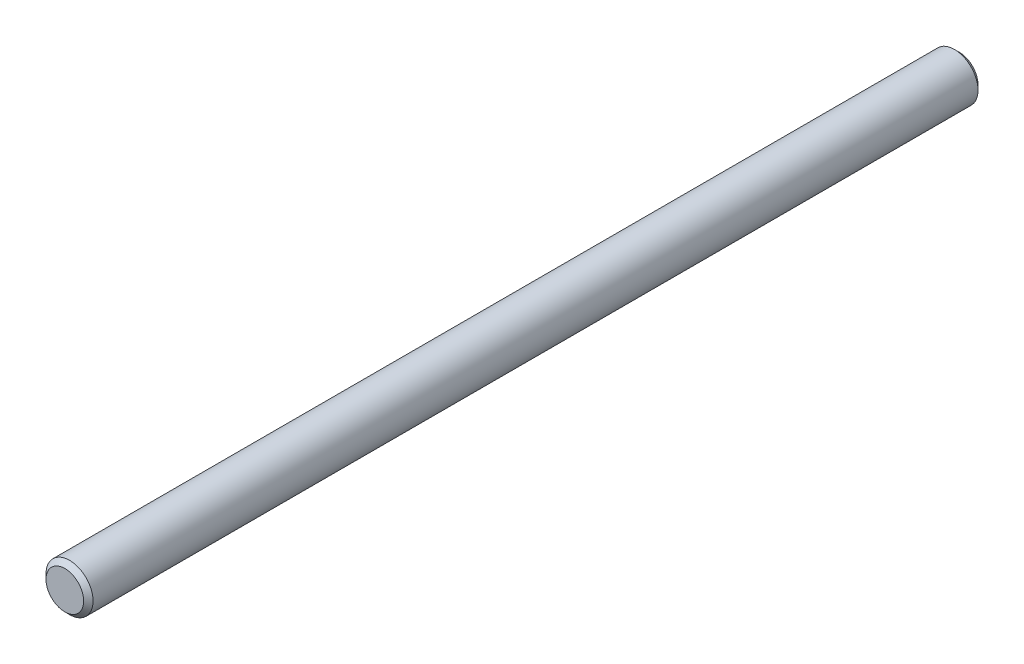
from build123d import *

# Parameters (mm, degrees)
ESQUISSE1_R      = 1.5
EXTRUSION1_DEPTH = 57
CHANFREIN1_SIZE  = 0.3


with BuildPart() as part:
    # Esquisse1 → Extrusion1 (new body)
    with BuildSketch(Plane.XY):
        with Locations(Location((0, 0, 0), (0, 0, 180))):
            Circle(ESQUISSE1_R)
    extrude(amount=EXTRUSION1_DEPTH)

    # Chanfrein1
    chanfrein1_edges = [part.edges().sort_by_distance(p)[0] for p in [
        (1.5, 0, 0),
        (1.5, 0, 57),
    ]]
    chamfer(chanfrein1_edges, length=CHANFREIN1_SIZE)


solid = part.part
